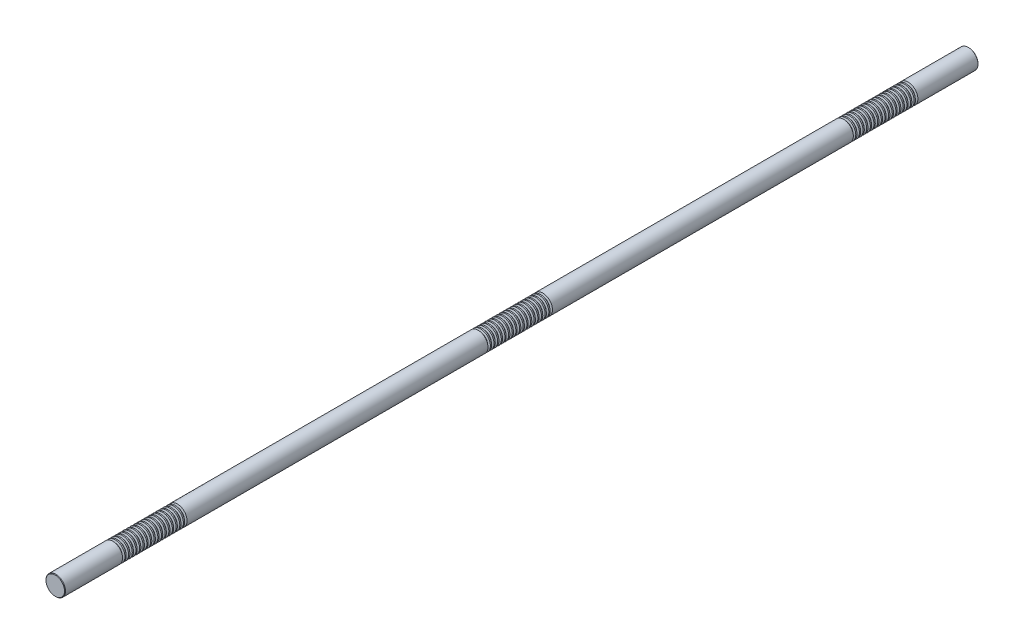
from build123d import *

# Parameters (mm, degrees)
SKETCH1_R           = 16
BOSS_EXTRUDE1_DEPTH = 750
CHAMFER1_SIZE       = 0.8
LPATTERN1_COUNT     = 18
LPATTERN1_PITCH     = 6
LPATTERN2_COUNT     = 3
LPATTERN2_PITCH     = 600


with BuildPart() as part:
    # Sketch1 → Boss-Extrude1 (new, symmetric)
    with BuildSketch(Plane.XY):
        Circle(SKETCH1_R)
    extrude(amount=BOSS_EXTRUDE1_DEPTH, both=True)

    # Chamfer1
    chamfer1_edges = [part.edges().sort_by_distance(p)[0] for p in [
        (-16, 0, -750),
        (-16, 0, 750),
    ]]
    chamfer(chamfer1_edges, length=CHAMFER1_SIZE)

    # Sketch2 → Cut-Revolve1 (revolve, cut)
    with BuildSketch(Plane(origin=(0, 0, 0), x_dir=(0, 0, -1), z_dir=(1, 0, 0)), mode=Mode.PRIVATE) as cut_revolve1_sk:
        Polygon((650.468911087, 16), (646.531088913, 16), (647.468911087, 12.5), (649.531088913, 12.5), align=None)
    cut_revolve1 = revolve(cut_revolve1_sk.sketch.rotate(Axis((0, 0, 750), (0, 0, -1)), 90), axis=Axis((0, 0, 750), (0, 0, -1)), mode=Mode.SUBTRACT)

    # LPattern1: Cut-Revolve1 ×18
    with Locations(*[(0, 0, i * LPATTERN1_PITCH) for i in range(1, LPATTERN1_COUNT)]):
        add(cut_revolve1, mode=Mode.SUBTRACT)

    # LPattern2: Cut-Revolve1 ×3
    with Locations(*[(0, 0, i * LPATTERN2_PITCH) for i in range(1, LPATTERN2_COUNT)]):
        add(cut_revolve1, mode=Mode.SUBTRACT)

    # LPattern2 copy 1 sketch → LPattern2 copy 1 (revolve, cut)
    with BuildSketch(Plane(origin=(0, 0, 606), x_dir=(0, 0, -1), z_dir=(1, 0, 0))):
        Polygon((650.468911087, 16), (646.531088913, 16), (647.468911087, 12.5), (649.531088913, 12.5), align=None)
    revolve(axis=Axis((0, 0, 1356), (0, 0, -1)), mode=Mode.SUBTRACT)

    # LPattern2 copy 2 sketch → LPattern2 copy 2 (revolve, cut)
    with BuildSketch(Plane(origin=(0, 0, 1206), x_dir=(0, 0, -1), z_dir=(1, 0, 0))):
        Polygon((650.468911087, 16), (646.531088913, 16), (647.468911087, 12.5), (649.531088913, 12.5), align=None)
    revolve(axis=Axis((0, 0, 1956), (0, 0, -1)), mode=Mode.SUBTRACT)

    # LPattern2 copy 3 sketch → LPattern2 copy 3 (revolve, cut)
    with BuildSketch(Plane(origin=(0, 0, 612), x_dir=(0, 0, -1), z_dir=(1, 0, 0))):
        Polygon((650.468911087, 16), (646.531088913, 16), (647.468911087, 12.5), (649.531088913, 12.5), align=None)
    revolve(axis=Axis((0, 0, 1362), (0, 0, -1)), mode=Mode.SUBTRACT)

    # LPattern2 copy 4 sketch → LPattern2 copy 4 (revolve, cut)
    with BuildSketch(Plane(origin=(0, 0, 1212), x_dir=(0, 0, -1), z_dir=(1, 0, 0))):
        Polygon((650.468911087, 16), (646.531088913, 16), (647.468911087, 12.5), (649.531088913, 12.5), align=None)
    revolve(axis=Axis((0, 0, 1962), (0, 0, -1)), mode=Mode.SUBTRACT)

    # LPattern2 copy 5 sketch → LPattern2 copy 5 (revolve, cut)
    with BuildSketch(Plane(origin=(0, 0, 618), x_dir=(0, 0, -1), z_dir=(1, 0, 0))):
        Polygon((650.468911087, 16), (646.531088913, 16), (647.468911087, 12.5), (649.531088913, 12.5), align=None)
    revolve(axis=Axis((0, 0, 1368), (0, 0, -1)), mode=Mode.SUBTRACT)

    # LPattern2 copy 6 sketch → LPattern2 copy 6 (revolve, cut)
    with BuildSketch(Plane(origin=(0, 0, 1218), x_dir=(0, 0, -1), z_dir=(1, 0, 0))):
        Polygon((650.468911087, 16), (646.531088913, 16), (647.468911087, 12.5), (649.531088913, 12.5), align=None)
    revolve(axis=Axis((0, 0, 1968), (0, 0, -1)), mode=Mode.SUBTRACT)

    # LPattern2 copy 7 sketch → LPattern2 copy 7 (revolve, cut)
    with BuildSketch(Plane(origin=(0, 0, 624), x_dir=(0, 0, -1), z_dir=(1, 0, 0))):
        Polygon((650.468911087, 16), (646.531088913, 16), (647.468911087, 12.5), (649.531088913, 12.5), align=None)
    revolve(axis=Axis((0, 0, 1374), (0, 0, -1)), mode=Mode.SUBTRACT)

    # LPattern2 copy 8 sketch → LPattern2 copy 8 (revolve, cut)
    with BuildSketch(Plane(origin=(0, 0, 1224), x_dir=(0, 0, -1), z_dir=(1, 0, 0))):
        Polygon((650.468911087, 16), (646.531088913, 16), (647.468911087, 12.5), (649.531088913, 12.5), align=None)
    revolve(axis=Axis((0, 0, 1974), (0, 0, -1)), mode=Mode.SUBTRACT)

    # LPattern2 copy 9 sketch → LPattern2 copy 9 (revolve, cut)
    with BuildSketch(Plane(origin=(0, 0, 630), x_dir=(0, 0, -1), z_dir=(1, 0, 0))):
        Polygon((650.468911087, 16), (646.531088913, 16), (647.468911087, 12.5), (649.531088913, 12.5), align=None)
    revolve(axis=Axis((0, 0, 1380), (0, 0, -1)), mode=Mode.SUBTRACT)

    # LPattern2 copy 10 sketch → LPattern2 copy 10 (revolve, cut)
    with BuildSketch(Plane(origin=(0, 0, 1230), x_dir=(0, 0, -1), z_dir=(1, 0, 0))):
        Polygon((650.468911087, 16), (646.531088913, 16), (647.468911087, 12.5), (649.531088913, 12.5), align=None)
    revolve(axis=Axis((0, 0, 1980), (0, 0, -1)), mode=Mode.SUBTRACT)

    # LPattern2 copy 11 sketch → LPattern2 copy 11 (revolve, cut)
    with BuildSketch(Plane(origin=(0, 0, 636), x_dir=(0, 0, -1), z_dir=(1, 0, 0))):
        Polygon((650.468911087, 16), (646.531088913, 16), (647.468911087, 12.5), (649.531088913, 12.5), align=None)
    revolve(axis=Axis((0, 0, 1386), (0, 0, -1)), mode=Mode.SUBTRACT)

    # LPattern2 copy 12 sketch → LPattern2 copy 12 (revolve, cut)
    with BuildSketch(Plane(origin=(0, 0, 1236), x_dir=(0, 0, -1), z_dir=(1, 0, 0))):
        Polygon((650.468911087, 16), (646.531088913, 16), (647.468911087, 12.5), (649.531088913, 12.5), align=None)
    revolve(axis=Axis((0, 0, 1986), (0, 0, -1)), mode=Mode.SUBTRACT)

    # LPattern2 copy 13 sketch → LPattern2 copy 13 (revolve, cut)
    with BuildSketch(Plane(origin=(0, 0, 642), x_dir=(0, 0, -1), z_dir=(1, 0, 0))):
        Polygon((650.468911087, 16), (646.531088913, 16), (647.468911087, 12.5), (649.531088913, 12.5), align=None)
    revolve(axis=Axis((0, 0, 1392), (0, 0, -1)), mode=Mode.SUBTRACT)

    # LPattern2 copy 14 sketch → LPattern2 copy 14 (revolve, cut)
    with BuildSketch(Plane(origin=(0, 0, 1242), x_dir=(0, 0, -1), z_dir=(1, 0, 0))):
        Polygon((650.468911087, 16), (646.531088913, 16), (647.468911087, 12.5), (649.531088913, 12.5), align=None)
    revolve(axis=Axis((0, 0, 1992), (0, 0, -1)), mode=Mode.SUBTRACT)

    # LPattern2 copy 15 sketch → LPattern2 copy 15 (revolve, cut)
    with BuildSketch(Plane(origin=(0, 0, 648), x_dir=(0, 0, -1), z_dir=(1, 0, 0))):
        Polygon((650.468911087, 16), (646.531088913, 16), (647.468911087, 12.5), (649.531088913, 12.5), align=None)
    revolve(axis=Axis((0, 0, 1398), (0, 0, -1)), mode=Mode.SUBTRACT)

    # LPattern2 copy 16 sketch → LPattern2 copy 16 (revolve, cut)
    with BuildSketch(Plane(origin=(0, 0, 1248), x_dir=(0, 0, -1), z_dir=(1, 0, 0))):
        Polygon((650.468911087, 16), (646.531088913, 16), (647.468911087, 12.5), (649.531088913, 12.5), align=None)
    revolve(axis=Axis((0, 0, 1998), (0, 0, -1)), mode=Mode.SUBTRACT)

    # LPattern2 copy 17 sketch → LPattern2 copy 17 (revolve, cut)
    with BuildSketch(Plane(origin=(0, 0, 654), x_dir=(0, 0, -1), z_dir=(1, 0, 0))):
        Polygon((650.468911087, 16), (646.531088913, 16), (647.468911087, 12.5), (649.531088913, 12.5), align=None)
    revolve(axis=Axis((0, 0, 1404), (0, 0, -1)), mode=Mode.SUBTRACT)

    # LPattern2 copy 18 sketch → LPattern2 copy 18 (revolve, cut)
    with BuildSketch(Plane(origin=(0, 0, 1254), x_dir=(0, 0, -1), z_dir=(1, 0, 0))):
        Polygon((650.468911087, 16), (646.531088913, 16), (647.468911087, 12.5), (649.531088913, 12.5), align=None)
    revolve(axis=Axis((0, 0, 2004), (0, 0, -1)), mode=Mode.SUBTRACT)

    # LPattern2 copy 19 sketch → LPattern2 copy 19 (revolve, cut)
    with BuildSketch(Plane(origin=(0, 0, 660), x_dir=(0, 0, -1), z_dir=(1, 0, 0))):
        Polygon((650.468911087, 16), (646.531088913, 16), (647.468911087, 12.5), (649.531088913, 12.5), align=None)
    revolve(axis=Axis((0, 0, 1410), (0, 0, -1)), mode=Mode.SUBTRACT)

    # LPattern2 copy 20 sketch → LPattern2 copy 20 (revolve, cut)
    with BuildSketch(Plane(origin=(0, 0, 1260), x_dir=(0, 0, -1), z_dir=(1, 0, 0))):
        Polygon((650.468911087, 16), (646.531088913, 16), (647.468911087, 12.5), (649.531088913, 12.5), align=None)
    revolve(axis=Axis((0, 0, 2010), (0, 0, -1)), mode=Mode.SUBTRACT)

    # LPattern2 copy 21 sketch → LPattern2 copy 21 (revolve, cut)
    with BuildSketch(Plane(origin=(0, 0, 666), x_dir=(0, 0, -1), z_dir=(1, 0, 0))):
        Polygon((650.468911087, 16), (646.531088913, 16), (647.468911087, 12.5), (649.531088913, 12.5), align=None)
    revolve(axis=Axis((0, 0, 1416), (0, 0, -1)), mode=Mode.SUBTRACT)

    # LPattern2 copy 22 sketch → LPattern2 copy 22 (revolve, cut)
    with BuildSketch(Plane(origin=(0, 0, 1266), x_dir=(0, 0, -1), z_dir=(1, 0, 0))):
        Polygon((650.468911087, 16), (646.531088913, 16), (647.468911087, 12.5), (649.531088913, 12.5), align=None)
    revolve(axis=Axis((0, 0, 2016), (0, 0, -1)), mode=Mode.SUBTRACT)

    # LPattern2 copy 23 sketch → LPattern2 copy 23 (revolve, cut)
    with BuildSketch(Plane(origin=(0, 0, 672), x_dir=(0, 0, -1), z_dir=(1, 0, 0))):
        Polygon((650.468911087, 16), (646.531088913, 16), (647.468911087, 12.5), (649.531088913, 12.5), align=None)
    revolve(axis=Axis((0, 0, 1422), (0, 0, -1)), mode=Mode.SUBTRACT)

    # LPattern2 copy 24 sketch → LPattern2 copy 24 (revolve, cut)
    with BuildSketch(Plane(origin=(0, 0, 1272), x_dir=(0, 0, -1), z_dir=(1, 0, 0))):
        Polygon((650.468911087, 16), (646.531088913, 16), (647.468911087, 12.5), (649.531088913, 12.5), align=None)
    revolve(axis=Axis((0, 0, 2022), (0, 0, -1)), mode=Mode.SUBTRACT)

    # LPattern2 copy 25 sketch → LPattern2 copy 25 (revolve, cut)
    with BuildSketch(Plane(origin=(0, 0, 678), x_dir=(0, 0, -1), z_dir=(1, 0, 0))):
        Polygon((650.468911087, 16), (646.531088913, 16), (647.468911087, 12.5), (649.531088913, 12.5), align=None)
    revolve(axis=Axis((0, 0, 1428), (0, 0, -1)), mode=Mode.SUBTRACT)

    # LPattern2 copy 26 sketch → LPattern2 copy 26 (revolve, cut)
    with BuildSketch(Plane(origin=(0, 0, 1278), x_dir=(0, 0, -1), z_dir=(1, 0, 0))):
        Polygon((650.468911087, 16), (646.531088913, 16), (647.468911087, 12.5), (649.531088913, 12.5), align=None)
    revolve(axis=Axis((0, 0, 2028), (0, 0, -1)), mode=Mode.SUBTRACT)

    # LPattern2 copy 27 sketch → LPattern2 copy 27 (revolve, cut)
    with BuildSketch(Plane(origin=(0, 0, 684), x_dir=(0, 0, -1), z_dir=(1, 0, 0))):
        Polygon((650.468911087, 16), (646.531088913, 16), (647.468911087, 12.5), (649.531088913, 12.5), align=None)
    revolve(axis=Axis((0, 0, 1434), (0, 0, -1)), mode=Mode.SUBTRACT)

    # LPattern2 copy 28 sketch → LPattern2 copy 28 (revolve, cut)
    with BuildSketch(Plane(origin=(0, 0, 1284), x_dir=(0, 0, -1), z_dir=(1, 0, 0))):
        Polygon((650.468911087, 16), (646.531088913, 16), (647.468911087, 12.5), (649.531088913, 12.5), align=None)
    revolve(axis=Axis((0, 0, 2034), (0, 0, -1)), mode=Mode.SUBTRACT)

    # LPattern2 copy 29 sketch → LPattern2 copy 29 (revolve, cut)
    with BuildSketch(Plane(origin=(0, 0, 690), x_dir=(0, 0, -1), z_dir=(1, 0, 0))):
        Polygon((650.468911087, 16), (646.531088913, 16), (647.468911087, 12.5), (649.531088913, 12.5), align=None)
    revolve(axis=Axis((0, 0, 1440), (0, 0, -1)), mode=Mode.SUBTRACT)

    # LPattern2 copy 30 sketch → LPattern2 copy 30 (revolve, cut)
    with BuildSketch(Plane(origin=(0, 0, 1290), x_dir=(0, 0, -1), z_dir=(1, 0, 0))):
        Polygon((650.468911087, 16), (646.531088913, 16), (647.468911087, 12.5), (649.531088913, 12.5), align=None)
    revolve(axis=Axis((0, 0, 2040), (0, 0, -1)), mode=Mode.SUBTRACT)

    # LPattern2 copy 31 sketch → LPattern2 copy 31 (revolve, cut)
    with BuildSketch(Plane(origin=(0, 0, 696), x_dir=(0, 0, -1), z_dir=(1, 0, 0))):
        Polygon((650.468911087, 16), (646.531088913, 16), (647.468911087, 12.5), (649.531088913, 12.5), align=None)
    revolve(axis=Axis((0, 0, 1446), (0, 0, -1)), mode=Mode.SUBTRACT)

    # LPattern2 copy 32 sketch → LPattern2 copy 32 (revolve, cut)
    with BuildSketch(Plane(origin=(0, 0, 1296), x_dir=(0, 0, -1), z_dir=(1, 0, 0))):
        Polygon((650.468911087, 16), (646.531088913, 16), (647.468911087, 12.5), (649.531088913, 12.5), align=None)
    revolve(axis=Axis((0, 0, 2046), (0, 0, -1)), mode=Mode.SUBTRACT)

    # LPattern2 copy 33 sketch → LPattern2 copy 33 (revolve, cut)
    with BuildSketch(Plane(origin=(0, 0, 702), x_dir=(0, 0, -1), z_dir=(1, 0, 0))):
        Polygon((650.468911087, 16), (646.531088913, 16), (647.468911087, 12.5), (649.531088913, 12.5), align=None)
    revolve(axis=Axis((0, 0, 1452), (0, 0, -1)), mode=Mode.SUBTRACT)

    # LPattern2 copy 34 sketch → LPattern2 copy 34 (revolve, cut)
    with BuildSketch(Plane(origin=(0, 0, 1302), x_dir=(0, 0, -1), z_dir=(1, 0, 0))):
        Polygon((650.468911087, 16), (646.531088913, 16), (647.468911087, 12.5), (649.531088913, 12.5), align=None)
    revolve(axis=Axis((0, 0, 2052), (0, 0, -1)), mode=Mode.SUBTRACT)


solid = part.part
